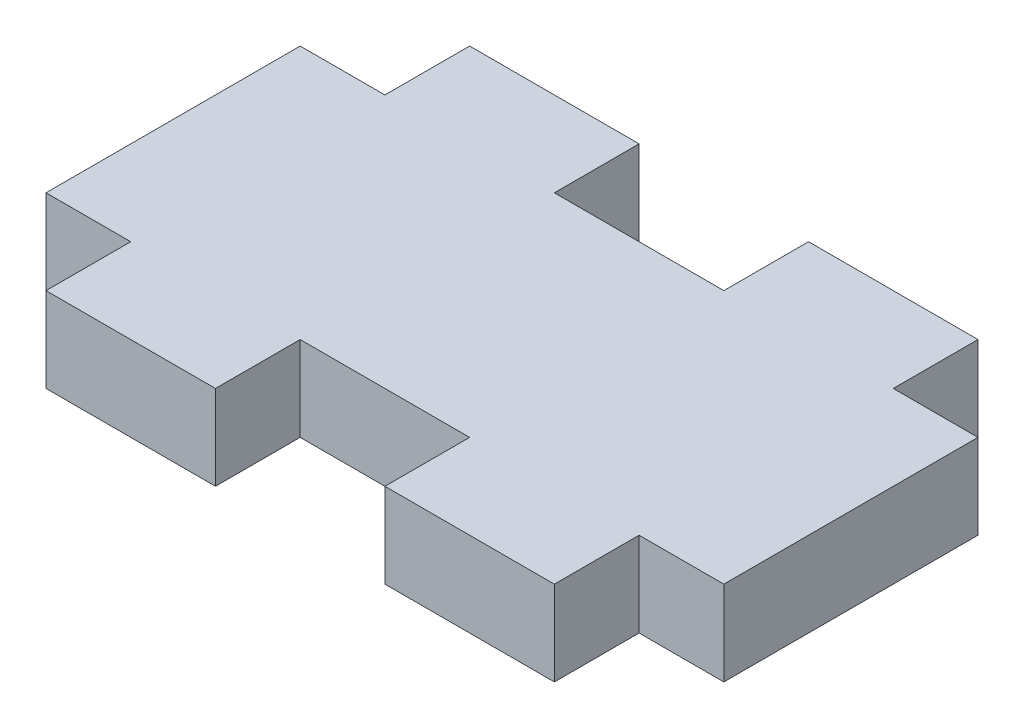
ISO-10303-21;
HEADER;
FILE_DESCRIPTION(('STEP AP214'),'2;1');
FILE_NAME('part.step','',(''),(''),'','','');
FILE_SCHEMA(('AUTOMOTIVE_DESIGN { 1 0 10303 214 1 1 1 1 }'));
ENDSEC;
DATA;
#1=APPLICATION_CONTEXT('core data for automotive mechanical design processes');
#2=APPLICATION_PROTOCOL_DEFINITION('international standard','automotive_design',2000,#1);
#3=PRODUCT_CONTEXT('',#1,'mechanical');
#4=PRODUCT('Part','Part','',(#3));
#5=PRODUCT_RELATED_PRODUCT_CATEGORY('part','',(#4));
#6=PRODUCT_DEFINITION_FORMATION('','',#4);
#7=PRODUCT_DEFINITION_CONTEXT('part definition',#1,'design');
#8=PRODUCT_DEFINITION('design','',#6,#7);
#9=PRODUCT_DEFINITION_SHAPE('','',#8);
#10=(LENGTH_UNIT() NAMED_UNIT(*) SI_UNIT(.MILLI.,.METRE.));
#11=(NAMED_UNIT(*) PLANE_ANGLE_UNIT() SI_UNIT($,.RADIAN.));
#12=(NAMED_UNIT(*) SI_UNIT($,.STERADIAN.) SOLID_ANGLE_UNIT());
#13=UNCERTAINTY_MEASURE_WITH_UNIT(LENGTH_MEASURE(1.E-05),#10,'distance_accuracy_value','');
#14=(GEOMETRIC_REPRESENTATION_CONTEXT(3) GLOBAL_UNCERTAINTY_ASSIGNED_CONTEXT((#13)) GLOBAL_UNIT_ASSIGNED_CONTEXT((#10,
#11,#12)) REPRESENTATION_CONTEXT('',''));
#15=CARTESIAN_POINT('',(0.,0.,0.));
#16=DIRECTION('',(0.,0.,1.));
#17=DIRECTION('',(1.,0.,0.));
#18=AXIS2_PLACEMENT_3D('',#15,#16,#17);
#19=CARTESIAN_POINT('',(-25.4,3.175,9.525));
#20=DIRECTION('',(0.,0.,-1.));
#21=DIRECTION('',(-1.,0.,0.));
#22=AXIS2_PLACEMENT_3D('',#19,#20,#21);
#23=PLANE('',#22);
#24=DIRECTION('',(0.,1.,0.));
#25=VECTOR('',#24,1.);
#26=CARTESIAN_POINT('',(19.05,-17.3740316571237,9.52500000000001));
#27=LINE('',#26,#25);
#28=CARTESIAN_POINT('',(19.05,-3.175,9.52500000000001));
#29=VERTEX_POINT('',#28);
#30=CARTESIAN_POINT('',(19.05,3.175,9.525));
#31=VERTEX_POINT('',#30);
#32=EDGE_CURVE('E207',#29,#31,#27,.T.);
#33=ORIENTED_EDGE('',*,*,#32,.F.);
#34=DIRECTION('',(1.,0.,0.));
#35=VECTOR('',#34,1.);
#36=CARTESIAN_POINT('',(-25.4,-3.175,9.525));
#37=LINE('',#36,#35);
#38=CARTESIAN_POINT('',(25.4,-3.175,9.525));
#39=VERTEX_POINT('',#38);
#40=EDGE_CURVE('E246',#29,#39,#37,.T.);
#41=ORIENTED_EDGE('',*,*,#40,.T.);
#42=DIRECTION('',(0.,-1.,0.));
#43=VECTOR('',#42,1.);
#44=CARTESIAN_POINT('',(25.4,3.175,9.525));
#45=LINE('',#44,#43);
#46=CARTESIAN_POINT('',(25.4,3.175,9.525));
#47=VERTEX_POINT('',#46);
#48=EDGE_CURVE('E254',#47,#39,#45,.T.);
#49=ORIENTED_EDGE('',*,*,#48,.F.);
#50=DIRECTION('',(1.,0.,0.));
#51=VECTOR('',#50,1.);
#52=CARTESIAN_POINT('',(-25.4,3.175,9.525));
#53=LINE('',#52,#51);
#54=EDGE_CURVE('E38',#31,#47,#53,.T.);
#55=ORIENTED_EDGE('',*,*,#54,.F.);
#56=EDGE_LOOP('',(#33,#41,#49,#55));
#57=FACE_BOUND('',#56,.T.);
#58=ADVANCED_FACE('F34',(#57),#23,.F.);
#59=DIRECTION('',(0.,1.,0.));
#60=VECTOR('',#59,1.);
#61=CARTESIAN_POINT('',(6.35,-17.3740316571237,9.525));
#62=LINE('',#61,#60);
#63=CARTESIAN_POINT('',(6.35,-3.175,9.525));
#64=VERTEX_POINT('',#63);
#65=CARTESIAN_POINT('',(6.35,3.175,9.525));
#66=VERTEX_POINT('',#65);
#67=EDGE_CURVE('E59',#64,#66,#62,.T.);
#68=ORIENTED_EDGE('',*,*,#67,.T.);
#69=CARTESIAN_POINT('',(-6.35,3.175,9.525));
#70=VERTEX_POINT('',#69);
#71=EDGE_CURVE('E199',#70,#66,#53,.T.);
#72=ORIENTED_EDGE('',*,*,#71,.F.);
#73=DIRECTION('',(0.,1.,0.));
#74=VECTOR('',#73,1.);
#75=CARTESIAN_POINT('',(-6.35,-17.3740316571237,9.525));
#76=LINE('',#75,#74);
#77=CARTESIAN_POINT('',(-6.35,-3.175,9.525));
#78=VERTEX_POINT('',#77);
#79=EDGE_CURVE('E227',#78,#70,#76,.T.);
#80=ORIENTED_EDGE('',*,*,#79,.F.);
#81=EDGE_CURVE('E248',#78,#64,#37,.T.);
#82=ORIENTED_EDGE('',*,*,#81,.T.);
#83=EDGE_LOOP('',(#68,#72,#80,#82));
#84=FACE_BOUND('',#83,.T.);
#85=ADVANCED_FACE('F328',(#84),#23,.F.);
#86=CARTESIAN_POINT('',(-25.4,3.175,-9.525));
#87=DIRECTION('',(0.,0.,1.));
#88=DIRECTION('',(1.,0.,0.));
#89=AXIS2_PLACEMENT_3D('',#86,#87,#88);
#90=PLANE('',#89);
#91=DIRECTION('',(-1.,0.,0.));
#92=VECTOR('',#91,1.);
#93=CARTESIAN_POINT('',(-25.4,3.175,-9.525));
#94=LINE('',#93,#92);
#95=CARTESIAN_POINT('',(6.35,3.175,-9.525));
#96=VERTEX_POINT('',#95);
#97=CARTESIAN_POINT('',(-6.35,3.175,-9.525));
#98=VERTEX_POINT('',#97);
#99=EDGE_CURVE('E265',#96,#98,#94,.T.);
#100=ORIENTED_EDGE('',*,*,#99,.F.);
#101=DIRECTION('',(0.,1.,0.));
#102=VECTOR('',#101,1.);
#103=CARTESIAN_POINT('',(6.35,-17.3740316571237,-9.525));
#104=LINE('',#103,#102);
#105=CARTESIAN_POINT('',(6.35,-3.175,-9.525));
#106=VERTEX_POINT('',#105);
#107=EDGE_CURVE('E413',#106,#96,#104,.T.);
#108=ORIENTED_EDGE('',*,*,#107,.F.);
#109=DIRECTION('',(-1.,0.,0.));
#110=VECTOR('',#109,1.);
#111=CARTESIAN_POINT('',(-25.4,-3.175,-9.525));
#112=LINE('',#111,#110);
#113=CARTESIAN_POINT('',(-6.35,-3.175,-9.525));
#114=VERTEX_POINT('',#113);
#115=EDGE_CURVE('E270',#106,#114,#112,.T.);
#116=ORIENTED_EDGE('',*,*,#115,.T.);
#117=DIRECTION('',(0.,1.,0.));
#118=VECTOR('',#117,1.);
#119=CARTESIAN_POINT('',(-6.35,-17.3740316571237,-9.525));
#120=LINE('',#119,#118);
#121=EDGE_CURVE('E364',#114,#98,#120,.T.);
#122=ORIENTED_EDGE('',*,*,#121,.T.);
#123=EDGE_LOOP('',(#100,#108,#116,#122));
#124=FACE_BOUND('',#123,.T.);
#125=ADVANCED_FACE('F333',(#124),#90,.F.);
#126=DIRECTION('',(0.,1.,0.));
#127=VECTOR('',#126,1.);
#128=CARTESIAN_POINT('',(-19.05,-17.3740316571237,-9.525));
#129=LINE('',#128,#127);
#130=CARTESIAN_POINT('',(-19.05,-3.175,-9.525));
#131=VERTEX_POINT('',#130);
#132=CARTESIAN_POINT('',(-19.05,3.175,-9.525));
#133=VERTEX_POINT('',#132);
#134=EDGE_CURVE('E359',#131,#133,#129,.T.);
#135=ORIENTED_EDGE('',*,*,#134,.F.);
#136=CARTESIAN_POINT('',(-25.4,-3.175,-9.525));
#137=VERTEX_POINT('',#136);
#138=EDGE_CURVE('E284',#131,#137,#112,.T.);
#139=ORIENTED_EDGE('',*,*,#138,.T.);
#140=DIRECTION('',(0.,-1.,0.));
#141=VECTOR('',#140,1.);
#142=CARTESIAN_POINT('',(-25.4,3.175,-9.525));
#143=LINE('',#142,#141);
#144=CARTESIAN_POINT('',(-25.4,3.175,-9.525));
#145=VERTEX_POINT('',#144);
#146=EDGE_CURVE('E44',#145,#137,#143,.T.);
#147=ORIENTED_EDGE('',*,*,#146,.F.);
#148=EDGE_CURVE('E269',#133,#145,#94,.T.);
#149=ORIENTED_EDGE('',*,*,#148,.F.);
#150=EDGE_LOOP('',(#135,#139,#147,#149));
#151=FACE_BOUND('',#150,.T.);
#152=ADVANCED_FACE('F347',(#151),#90,.F.);
#153=CARTESIAN_POINT('',(25.4,3.175,-9.525));
#154=DIRECTION('',(-1.,0.,0.));
#155=DIRECTION('',(0.,0.,1.));
#156=AXIS2_PLACEMENT_3D('',#153,#154,#155);
#157=PLANE('',#156);
#158=DIRECTION('',(0.,0.,-1.));
#159=VECTOR('',#158,1.);
#160=CARTESIAN_POINT('',(25.4,-3.175,-9.525));
#161=LINE('',#160,#159);
#162=CARTESIAN_POINT('',(25.4,-3.175,-9.525));
#163=VERTEX_POINT('',#162);
#164=EDGE_CURVE('E286',#39,#163,#161,.T.);
#165=ORIENTED_EDGE('',*,*,#164,.T.);
#166=DIRECTION('',(0.,-1.,0.));
#167=VECTOR('',#166,1.);
#168=CARTESIAN_POINT('',(25.4,3.175,-9.525));
#169=LINE('',#168,#167);
#170=CARTESIAN_POINT('',(25.4,3.175,-9.525));
#171=VERTEX_POINT('',#170);
#172=EDGE_CURVE('E11',#171,#163,#169,.T.);
#173=ORIENTED_EDGE('',*,*,#172,.F.);
#174=DIRECTION('',(0.,0.,-1.));
#175=VECTOR('',#174,1.);
#176=CARTESIAN_POINT('',(25.4,3.175,-9.525));
#177=LINE('',#176,#175);
#178=EDGE_CURVE('E264',#47,#171,#177,.T.);
#179=ORIENTED_EDGE('',*,*,#178,.F.);
#180=ORIENTED_EDGE('',*,*,#48,.T.);
#181=EDGE_LOOP('',(#165,#173,#179,#180));
#182=FACE_BOUND('',#181,.T.);
#183=ADVANCED_FACE('F36',(#182),#157,.F.);
#184=CARTESIAN_POINT('',(19.05,-3.175,-9.525));
#185=VERTEX_POINT('',#184);
#186=EDGE_CURVE('E287',#163,#185,#112,.T.);
#187=ORIENTED_EDGE('',*,*,#186,.T.);
#188=DIRECTION('',(0.,1.,0.));
#189=VECTOR('',#188,1.);
#190=CARTESIAN_POINT('',(19.05,-17.3740316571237,-9.52500000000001));
#191=LINE('',#190,#189);
#192=CARTESIAN_POINT('',(19.05,3.175,-9.525));
#193=VERTEX_POINT('',#192);
#194=EDGE_CURVE('E418',#185,#193,#191,.T.);
#195=ORIENTED_EDGE('',*,*,#194,.T.);
#196=EDGE_CURVE('E268',#171,#193,#94,.T.);
#197=ORIENTED_EDGE('',*,*,#196,.F.);
#198=ORIENTED_EDGE('',*,*,#172,.T.);
#199=EDGE_LOOP('',(#187,#195,#197,#198));
#200=FACE_BOUND('',#199,.T.);
#201=ADVANCED_FACE('F342',(#200),#90,.F.);
#202=CARTESIAN_POINT('',(-25.4,3.175,-9.525));
#203=DIRECTION('',(1.,0.,0.));
#204=DIRECTION('',(0.,0.,-1.));
#205=AXIS2_PLACEMENT_3D('',#202,#203,#204);
#206=PLANE('',#205);
#207=DIRECTION('',(0.,0.,1.));
#208=VECTOR('',#207,1.);
#209=CARTESIAN_POINT('',(-25.4,-3.175,-9.525));
#210=LINE('',#209,#208);
#211=CARTESIAN_POINT('',(-25.4,-3.175,9.525));
#212=VERTEX_POINT('',#211);
#213=EDGE_CURVE('E249',#137,#212,#210,.T.);
#214=ORIENTED_EDGE('',*,*,#213,.T.);
#215=DIRECTION('',(0.,-1.,0.));
#216=VECTOR('',#215,1.);
#217=CARTESIAN_POINT('',(-25.4,3.175,9.525));
#218=LINE('',#217,#216);
#219=CARTESIAN_POINT('',(-25.4,3.175,9.525));
#220=VERTEX_POINT('',#219);
#221=EDGE_CURVE('E303',#220,#212,#218,.T.);
#222=ORIENTED_EDGE('',*,*,#221,.F.);
#223=DIRECTION('',(0.,0.,1.));
#224=VECTOR('',#223,1.);
#225=CARTESIAN_POINT('',(-25.4,3.175,-9.525));
#226=LINE('',#225,#224);
#227=EDGE_CURVE('E276',#145,#220,#226,.T.);
#228=ORIENTED_EDGE('',*,*,#227,.F.);
#229=ORIENTED_EDGE('',*,*,#146,.T.);
#230=EDGE_LOOP('',(#214,#222,#228,#229));
#231=FACE_BOUND('',#230,.T.);
#232=ADVANCED_FACE('F311',(#231),#206,.F.);
#233=CARTESIAN_POINT('',(-19.05,-3.175,9.525));
#234=VERTEX_POINT('',#233);
#235=EDGE_CURVE('E261',#212,#234,#37,.T.);
#236=ORIENTED_EDGE('',*,*,#235,.T.);
#237=DIRECTION('',(0.,1.,0.));
#238=VECTOR('',#237,1.);
#239=CARTESIAN_POINT('',(-19.05,-17.3740316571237,9.525));
#240=LINE('',#239,#238);
#241=CARTESIAN_POINT('',(-19.05,3.175,9.525));
#242=VERTEX_POINT('',#241);
#243=EDGE_CURVE('E222',#234,#242,#240,.T.);
#244=ORIENTED_EDGE('',*,*,#243,.T.);
#245=EDGE_CURVE('E298',#220,#242,#53,.T.);
#246=ORIENTED_EDGE('',*,*,#245,.F.);
#247=ORIENTED_EDGE('',*,*,#221,.T.);
#248=EDGE_LOOP('',(#236,#244,#246,#247));
#249=FACE_BOUND('',#248,.T.);
#250=ADVANCED_FACE('F315',(#249),#23,.F.);
#251=CARTESIAN_POINT('',(0.,3.175,0.));
#252=DIRECTION('',(0.,1.,0.));
#253=DIRECTION('',(0.,0.,1.));
#254=AXIS2_PLACEMENT_3D('',#251,#252,#253);
#255=PLANE('',#254);
#256=ORIENTED_EDGE('',*,*,#178,.T.);
#257=ORIENTED_EDGE('',*,*,#196,.T.);
#258=DIRECTION('',(0.,0.,-1.));
#259=VECTOR('',#258,1.);
#260=CARTESIAN_POINT('',(19.05,3.175,-9.52500000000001));
#261=LINE('',#260,#259);
#262=CARTESIAN_POINT('',(19.05,3.175,-15.875));
#263=VERTEX_POINT('',#262);
#264=EDGE_CURVE('E407',#193,#263,#261,.T.);
#265=ORIENTED_EDGE('',*,*,#264,.T.);
#266=DIRECTION('',(-1.,0.,0.));
#267=VECTOR('',#266,1.);
#268=CARTESIAN_POINT('',(6.35,3.175,-15.875));
#269=LINE('',#268,#267);
#270=CARTESIAN_POINT('',(6.35,3.175,-15.875));
#271=VERTEX_POINT('',#270);
#272=EDGE_CURVE('E410',#263,#271,#269,.T.);
#273=ORIENTED_EDGE('',*,*,#272,.T.);
#274=DIRECTION('',(0.,0.,1.));
#275=VECTOR('',#274,1.);
#276=CARTESIAN_POINT('',(6.35,3.175,-9.525));
#277=LINE('',#276,#275);
#278=EDGE_CURVE('E233',#271,#96,#277,.T.);
#279=ORIENTED_EDGE('',*,*,#278,.T.);
#280=ORIENTED_EDGE('',*,*,#99,.T.);
#281=DIRECTION('',(0.,0.,-1.));
#282=VECTOR('',#281,1.);
#283=CARTESIAN_POINT('',(-6.35,3.175,-9.525));
#284=LINE('',#283,#282);
#285=CARTESIAN_POINT('',(-6.35,3.175,-15.875));
#286=VERTEX_POINT('',#285);
#287=EDGE_CURVE('E388',#98,#286,#284,.T.);
#288=ORIENTED_EDGE('',*,*,#287,.T.);
#289=DIRECTION('',(-1.,0.,0.));
#290=VECTOR('',#289,1.);
#291=CARTESIAN_POINT('',(-19.05,3.175,-15.875));
#292=LINE('',#291,#290);
#293=CARTESIAN_POINT('',(-19.05,3.175,-15.875));
#294=VERTEX_POINT('',#293);
#295=EDGE_CURVE('E365',#286,#294,#292,.T.);
#296=ORIENTED_EDGE('',*,*,#295,.T.);
#297=DIRECTION('',(0.,0.,1.));
#298=VECTOR('',#297,1.);
#299=CARTESIAN_POINT('',(-19.05,3.175,-9.525));
#300=LINE('',#299,#298);
#301=EDGE_CURVE('E393',#294,#133,#300,.T.);
#302=ORIENTED_EDGE('',*,*,#301,.T.);
#303=ORIENTED_EDGE('',*,*,#148,.T.);
#304=ORIENTED_EDGE('',*,*,#227,.T.);
#305=ORIENTED_EDGE('',*,*,#245,.T.);
#306=DIRECTION('',(0.,0.,-1.));
#307=VECTOR('',#306,1.);
#308=CARTESIAN_POINT('',(-19.05,3.175,9.525));
#309=LINE('',#308,#307);
#310=CARTESIAN_POINT('',(-19.05,3.175,15.875));
#311=VERTEX_POINT('',#310);
#312=EDGE_CURVE('E216',#311,#242,#309,.T.);
#313=ORIENTED_EDGE('',*,*,#312,.F.);
#314=DIRECTION('',(-1.,0.,0.));
#315=VECTOR('',#314,1.);
#316=CARTESIAN_POINT('',(-19.05,3.175,15.875));
#317=LINE('',#316,#315);
#318=CARTESIAN_POINT('',(-6.35,3.175,15.875));
#319=VERTEX_POINT('',#318);
#320=EDGE_CURVE('E212',#319,#311,#317,.T.);
#321=ORIENTED_EDGE('',*,*,#320,.F.);
#322=DIRECTION('',(0.,0.,1.));
#323=VECTOR('',#322,1.);
#324=CARTESIAN_POINT('',(-6.35,3.175,9.525));
#325=LINE('',#324,#323);
#326=EDGE_CURVE('E215',#70,#319,#325,.T.);
#327=ORIENTED_EDGE('',*,*,#326,.F.);
#328=ORIENTED_EDGE('',*,*,#71,.T.);
#329=DIRECTION('',(0.,0.,-1.));
#330=VECTOR('',#329,1.);
#331=CARTESIAN_POINT('',(6.35,3.175,9.525));
#332=LINE('',#331,#330);
#333=CARTESIAN_POINT('',(6.35,3.175,15.875));
#334=VERTEX_POINT('',#333);
#335=EDGE_CURVE('E180',#334,#66,#332,.T.);
#336=ORIENTED_EDGE('',*,*,#335,.F.);
#337=DIRECTION('',(-1.,0.,0.));
#338=VECTOR('',#337,1.);
#339=CARTESIAN_POINT('',(6.35,3.175,15.875));
#340=LINE('',#339,#338);
#341=CARTESIAN_POINT('',(19.05,3.175,15.875));
#342=VERTEX_POINT('',#341);
#343=EDGE_CURVE('E189',#342,#334,#340,.T.);
#344=ORIENTED_EDGE('',*,*,#343,.F.);
#345=DIRECTION('',(0.,0.,1.));
#346=VECTOR('',#345,1.);
#347=CARTESIAN_POINT('',(19.05,3.175,9.52500000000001));
#348=LINE('',#347,#346);
#349=EDGE_CURVE('E186',#31,#342,#348,.T.);
#350=ORIENTED_EDGE('',*,*,#349,.F.);
#351=ORIENTED_EDGE('',*,*,#54,.T.);
#352=EDGE_LOOP('',(#256,#257,#265,#273,#279,#280,#288,#296,#302,#303,#304,#305,#313,#321,#327,
#328,#336,#344,#350,#351));
#353=FACE_BOUND('',#352,.T.);
#354=ADVANCED_FACE('F197',(#353),#255,.T.);
#355=CARTESIAN_POINT('',(0.,-3.175,0.));
#356=DIRECTION('',(0.,1.,0.));
#357=DIRECTION('',(0.,0.,1.));
#358=AXIS2_PLACEMENT_3D('',#355,#356,#357);
#359=PLANE('',#358);
#360=ORIENTED_EDGE('',*,*,#164,.F.);
#361=ORIENTED_EDGE('',*,*,#40,.F.);
#362=DIRECTION('',(0.,0.,-1.));
#363=VECTOR('',#362,1.);
#364=CARTESIAN_POINT('',(19.05,-3.175,9.52500000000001));
#365=LINE('',#364,#363);
#366=CARTESIAN_POINT('',(19.05,-3.175,15.875));
#367=VERTEX_POINT('',#366);
#368=EDGE_CURVE('E211',#367,#29,#365,.T.);
#369=ORIENTED_EDGE('',*,*,#368,.F.);
#370=DIRECTION('',(1.,0.,0.));
#371=VECTOR('',#370,1.);
#372=CARTESIAN_POINT('',(6.35,-3.175,15.875));
#373=LINE('',#372,#371);
#374=CARTESIAN_POINT('',(6.35,-3.175,15.875));
#375=VERTEX_POINT('',#374);
#376=EDGE_CURVE('E206',#375,#367,#373,.T.);
#377=ORIENTED_EDGE('',*,*,#376,.F.);
#378=DIRECTION('',(0.,0.,1.));
#379=VECTOR('',#378,1.);
#380=CARTESIAN_POINT('',(6.35,-3.175,9.525));
#381=LINE('',#380,#379);
#382=EDGE_CURVE('E182',#64,#375,#381,.T.);
#383=ORIENTED_EDGE('',*,*,#382,.F.);
#384=ORIENTED_EDGE('',*,*,#81,.F.);
#385=DIRECTION('',(0.,0.,-1.));
#386=VECTOR('',#385,1.);
#387=CARTESIAN_POINT('',(-6.35,-3.175,9.525));
#388=LINE('',#387,#386);
#389=CARTESIAN_POINT('',(-6.35,-3.175,15.875));
#390=VERTEX_POINT('',#389);
#391=EDGE_CURVE('E234',#390,#78,#388,.T.);
#392=ORIENTED_EDGE('',*,*,#391,.F.);
#393=DIRECTION('',(1.,0.,0.));
#394=VECTOR('',#393,1.);
#395=CARTESIAN_POINT('',(-19.05,-3.175,15.875));
#396=LINE('',#395,#394);
#397=CARTESIAN_POINT('',(-19.05,-3.175,15.875));
#398=VERTEX_POINT('',#397);
#399=EDGE_CURVE('E226',#398,#390,#396,.T.);
#400=ORIENTED_EDGE('',*,*,#399,.F.);
#401=DIRECTION('',(0.,0.,1.));
#402=VECTOR('',#401,1.);
#403=CARTESIAN_POINT('',(-19.05,-3.175,9.525));
#404=LINE('',#403,#402);
#405=EDGE_CURVE('E230',#234,#398,#404,.T.);
#406=ORIENTED_EDGE('',*,*,#405,.F.);
#407=ORIENTED_EDGE('',*,*,#235,.F.);
#408=ORIENTED_EDGE('',*,*,#213,.F.);
#409=ORIENTED_EDGE('',*,*,#138,.F.);
#410=DIRECTION('',(0.,0.,-1.));
#411=VECTOR('',#410,1.);
#412=CARTESIAN_POINT('',(-19.05,-3.175,-9.525));
#413=LINE('',#412,#411);
#414=CARTESIAN_POINT('',(-19.05,-3.175,-15.875));
#415=VERTEX_POINT('',#414);
#416=EDGE_CURVE('E293',#131,#415,#413,.T.);
#417=ORIENTED_EDGE('',*,*,#416,.T.);
#418=DIRECTION('',(1.,0.,0.));
#419=VECTOR('',#418,1.);
#420=CARTESIAN_POINT('',(-19.05,-3.175,-15.875));
#421=LINE('',#420,#419);
#422=CARTESIAN_POINT('',(-6.35,-3.175,-15.875));
#423=VERTEX_POINT('',#422);
#424=EDGE_CURVE('E370',#415,#423,#421,.T.);
#425=ORIENTED_EDGE('',*,*,#424,.T.);
#426=DIRECTION('',(0.,0.,1.));
#427=VECTOR('',#426,1.);
#428=CARTESIAN_POINT('',(-6.35,-3.175,-9.525));
#429=LINE('',#428,#427);
#430=EDGE_CURVE('E372',#423,#114,#429,.T.);
#431=ORIENTED_EDGE('',*,*,#430,.T.);
#432=ORIENTED_EDGE('',*,*,#115,.F.);
#433=DIRECTION('',(0.,0.,-1.));
#434=VECTOR('',#433,1.);
#435=CARTESIAN_POINT('',(6.35,-3.175,-9.525));
#436=LINE('',#435,#434);
#437=CARTESIAN_POINT('',(6.35,-3.175,-15.875));
#438=VERTEX_POINT('',#437);
#439=EDGE_CURVE('E394',#106,#438,#436,.T.);
#440=ORIENTED_EDGE('',*,*,#439,.T.);
#441=DIRECTION('',(1.,0.,0.));
#442=VECTOR('',#441,1.);
#443=CARTESIAN_POINT('',(6.35,-3.175,-15.875));
#444=LINE('',#443,#442);
#445=CARTESIAN_POINT('',(19.05,-3.175,-15.875));
#446=VERTEX_POINT('',#445);
#447=EDGE_CURVE('E397',#438,#446,#444,.T.);
#448=ORIENTED_EDGE('',*,*,#447,.T.);
#449=DIRECTION('',(0.,0.,1.));
#450=VECTOR('',#449,1.);
#451=CARTESIAN_POINT('',(19.05,-3.175,-9.52500000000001));
#452=LINE('',#451,#450);
#453=EDGE_CURVE('E401',#446,#185,#452,.T.);
#454=ORIENTED_EDGE('',*,*,#453,.T.);
#455=ORIENTED_EDGE('',*,*,#186,.F.);
#456=EDGE_LOOP('',(#360,#361,#369,#377,#383,#384,#392,#400,#406,#407,#408,#409,#417,#425,#431,
#432,#440,#448,#454,#455));
#457=FACE_BOUND('',#456,.T.);
#458=ADVANCED_FACE('F326',(#457),#359,.F.);
#459=CARTESIAN_POINT('',(-19.05,-17.3740316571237,-9.525));
#460=DIRECTION('',(-1.,0.,0.));
#461=DIRECTION('',(0.,0.,1.));
#462=AXIS2_PLACEMENT_3D('',#459,#460,#461);
#463=PLANE('',#462);
#464=ORIENTED_EDGE('',*,*,#416,.F.);
#465=ORIENTED_EDGE('',*,*,#134,.T.);
#466=ORIENTED_EDGE('',*,*,#301,.F.);
#467=DIRECTION('',(0.,1.,0.));
#468=VECTOR('',#467,1.);
#469=CARTESIAN_POINT('',(-19.05,-17.3740316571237,-15.875));
#470=LINE('',#469,#468);
#471=EDGE_CURVE('E369',#415,#294,#470,.T.);
#472=ORIENTED_EDGE('',*,*,#471,.F.);
#473=EDGE_LOOP('',(#464,#465,#466,#472));
#474=FACE_BOUND('',#473,.T.);
#475=ADVANCED_FACE('F368',(#474),#463,.T.);
#476=CARTESIAN_POINT('',(-19.05,-17.3740316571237,-15.875));
#477=DIRECTION('',(0.,0.,-1.));
#478=DIRECTION('',(-1.,0.,0.));
#479=AXIS2_PLACEMENT_3D('',#476,#477,#478);
#480=PLANE('',#479);
#481=ORIENTED_EDGE('',*,*,#424,.F.);
#482=ORIENTED_EDGE('',*,*,#471,.T.);
#483=ORIENTED_EDGE('',*,*,#295,.F.);
#484=DIRECTION('',(0.,1.,0.));
#485=VECTOR('',#484,1.);
#486=CARTESIAN_POINT('',(-6.35,-17.3740316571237,-15.875));
#487=LINE('',#486,#485);
#488=EDGE_CURVE('E387',#423,#286,#487,.T.);
#489=ORIENTED_EDGE('',*,*,#488,.F.);
#490=EDGE_LOOP('',(#481,#482,#483,#489));
#491=FACE_BOUND('',#490,.T.);
#492=ADVANCED_FACE('F430',(#491),#480,.T.);
#493=CARTESIAN_POINT('',(-6.35,-17.3740316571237,-9.525));
#494=DIRECTION('',(1.,0.,0.));
#495=DIRECTION('',(0.,0.,-1.));
#496=AXIS2_PLACEMENT_3D('',#493,#494,#495);
#497=PLANE('',#496);
#498=ORIENTED_EDGE('',*,*,#430,.F.);
#499=ORIENTED_EDGE('',*,*,#488,.T.);
#500=ORIENTED_EDGE('',*,*,#287,.F.);
#501=ORIENTED_EDGE('',*,*,#121,.F.);
#502=EDGE_LOOP('',(#498,#499,#500,#501));
#503=FACE_BOUND('',#502,.T.);
#504=ADVANCED_FACE('F428',(#503),#497,.T.);
#505=CARTESIAN_POINT('',(6.35,-17.3740316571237,-9.525));
#506=DIRECTION('',(-1.,0.,0.));
#507=DIRECTION('',(0.,0.,1.));
#508=AXIS2_PLACEMENT_3D('',#505,#506,#507);
#509=PLANE('',#508);
#510=ORIENTED_EDGE('',*,*,#439,.F.);
#511=ORIENTED_EDGE('',*,*,#107,.T.);
#512=ORIENTED_EDGE('',*,*,#278,.F.);
#513=DIRECTION('',(0.,1.,0.));
#514=VECTOR('',#513,1.);
#515=CARTESIAN_POINT('',(6.35,-17.3740316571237,-15.875));
#516=LINE('',#515,#514);
#517=EDGE_CURVE('E414',#438,#271,#516,.T.);
#518=ORIENTED_EDGE('',*,*,#517,.F.);
#519=EDGE_LOOP('',(#510,#511,#512,#518));
#520=FACE_BOUND('',#519,.T.);
#521=ADVANCED_FACE('F437',(#520),#509,.T.);
#522=CARTESIAN_POINT('',(6.35,-17.3740316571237,-15.875));
#523=DIRECTION('',(0.,0.,-1.));
#524=DIRECTION('',(-1.,0.,0.));
#525=AXIS2_PLACEMENT_3D('',#522,#523,#524);
#526=PLANE('',#525);
#527=ORIENTED_EDGE('',*,*,#447,.F.);
#528=ORIENTED_EDGE('',*,*,#517,.T.);
#529=ORIENTED_EDGE('',*,*,#272,.F.);
#530=DIRECTION('',(0.,1.,0.));
#531=VECTOR('',#530,1.);
#532=CARTESIAN_POINT('',(19.05,-17.3740316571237,-15.875));
#533=LINE('',#532,#531);
#534=EDGE_CURVE('E416',#446,#263,#533,.T.);
#535=ORIENTED_EDGE('',*,*,#534,.F.);
#536=EDGE_LOOP('',(#527,#528,#529,#535));
#537=FACE_BOUND('',#536,.T.);
#538=ADVANCED_FACE('F474',(#537),#526,.T.);
#539=CARTESIAN_POINT('',(19.05,-17.3740316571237,-9.52500000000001));
#540=DIRECTION('',(1.,0.,0.));
#541=DIRECTION('',(0.,0.,-1.));
#542=AXIS2_PLACEMENT_3D('',#539,#540,#541);
#543=PLANE('',#542);
#544=ORIENTED_EDGE('',*,*,#453,.F.);
#545=ORIENTED_EDGE('',*,*,#534,.T.);
#546=ORIENTED_EDGE('',*,*,#264,.F.);
#547=ORIENTED_EDGE('',*,*,#194,.F.);
#548=EDGE_LOOP('',(#544,#545,#546,#547));
#549=FACE_BOUND('',#548,.T.);
#550=ADVANCED_FACE('F483',(#549),#543,.T.);
#551=CARTESIAN_POINT('',(-19.05,-17.3740316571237,15.875));
#552=DIRECTION('',(0.,0.,-1.));
#553=DIRECTION('',(-1.,0.,0.));
#554=AXIS2_PLACEMENT_3D('',#551,#552,#553);
#555=PLANE('',#554);
#556=DIRECTION('',(0.,1.,0.));
#557=VECTOR('',#556,1.);
#558=CARTESIAN_POINT('',(-19.05,-17.3740316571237,15.875));
#559=LINE('',#558,#557);
#560=EDGE_CURVE('E244',#398,#311,#559,.T.);
#561=ORIENTED_EDGE('',*,*,#560,.F.);
#562=ORIENTED_EDGE('',*,*,#399,.T.);
#563=DIRECTION('',(0.,1.,0.));
#564=VECTOR('',#563,1.);
#565=CARTESIAN_POINT('',(-6.35,-17.3740316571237,15.875));
#566=LINE('',#565,#564);
#567=EDGE_CURVE('E238',#390,#319,#566,.T.);
#568=ORIENTED_EDGE('',*,*,#567,.T.);
#569=ORIENTED_EDGE('',*,*,#320,.T.);
#570=EDGE_LOOP('',(#561,#562,#568,#569));
#571=FACE_BOUND('',#570,.T.);
#572=ADVANCED_FACE('F492',(#571),#555,.F.);
#573=CARTESIAN_POINT('',(-6.35,-17.3740316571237,9.525));
#574=DIRECTION('',(-1.,0.,0.));
#575=DIRECTION('',(0.,0.,1.));
#576=AXIS2_PLACEMENT_3D('',#573,#574,#575);
#577=PLANE('',#576);
#578=ORIENTED_EDGE('',*,*,#567,.F.);
#579=ORIENTED_EDGE('',*,*,#391,.T.);
#580=ORIENTED_EDGE('',*,*,#79,.T.);
#581=ORIENTED_EDGE('',*,*,#326,.T.);
#582=EDGE_LOOP('',(#578,#579,#580,#581));
#583=FACE_BOUND('',#582,.T.);
#584=ADVANCED_FACE('F531',(#583),#577,.F.);
#585=CARTESIAN_POINT('',(-19.05,-17.3740316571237,9.525));
#586=DIRECTION('',(1.,0.,0.));
#587=DIRECTION('',(0.,0.,-1.));
#588=AXIS2_PLACEMENT_3D('',#585,#586,#587);
#589=PLANE('',#588);
#590=ORIENTED_EDGE('',*,*,#243,.F.);
#591=ORIENTED_EDGE('',*,*,#405,.T.);
#592=ORIENTED_EDGE('',*,*,#560,.T.);
#593=ORIENTED_EDGE('',*,*,#312,.T.);
#594=EDGE_LOOP('',(#590,#591,#592,#593));
#595=FACE_BOUND('',#594,.T.);
#596=ADVANCED_FACE('F318',(#595),#589,.F.);
#597=CARTESIAN_POINT('',(6.35,-17.3740316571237,15.875));
#598=DIRECTION('',(0.,0.,-1.));
#599=DIRECTION('',(-1.,0.,0.));
#600=AXIS2_PLACEMENT_3D('',#597,#598,#599);
#601=PLANE('',#600);
#602=DIRECTION('',(0.,1.,0.));
#603=VECTOR('',#602,1.);
#604=CARTESIAN_POINT('',(6.35,-17.3740316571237,15.875));
#605=LINE('',#604,#603);
#606=EDGE_CURVE('E176',#375,#334,#605,.T.);
#607=ORIENTED_EDGE('',*,*,#606,.F.);
#608=ORIENTED_EDGE('',*,*,#376,.T.);
#609=DIRECTION('',(0.,1.,0.));
#610=VECTOR('',#609,1.);
#611=CARTESIAN_POINT('',(19.05,-17.3740316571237,15.875));
#612=LINE('',#611,#610);
#613=EDGE_CURVE('E185',#367,#342,#612,.T.);
#614=ORIENTED_EDGE('',*,*,#613,.T.);
#615=ORIENTED_EDGE('',*,*,#343,.T.);
#616=EDGE_LOOP('',(#607,#608,#614,#615));
#617=FACE_BOUND('',#616,.T.);
#618=ADVANCED_FACE('F190',(#617),#601,.F.);
#619=CARTESIAN_POINT('',(19.05,-17.3740316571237,9.52500000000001));
#620=DIRECTION('',(-1.,0.,0.));
#621=DIRECTION('',(0.,0.,1.));
#622=AXIS2_PLACEMENT_3D('',#619,#620,#621);
#623=PLANE('',#622);
#624=ORIENTED_EDGE('',*,*,#613,.F.);
#625=ORIENTED_EDGE('',*,*,#368,.T.);
#626=ORIENTED_EDGE('',*,*,#32,.T.);
#627=ORIENTED_EDGE('',*,*,#349,.T.);
#628=EDGE_LOOP('',(#624,#625,#626,#627));
#629=FACE_BOUND('',#628,.T.);
#630=ADVANCED_FACE('F323',(#629),#623,.F.);
#631=CARTESIAN_POINT('',(6.35,-17.3740316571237,9.525));
#632=DIRECTION('',(1.,0.,0.));
#633=DIRECTION('',(0.,0.,-1.));
#634=AXIS2_PLACEMENT_3D('',#631,#632,#633);
#635=PLANE('',#634);
#636=ORIENTED_EDGE('',*,*,#67,.F.);
#637=ORIENTED_EDGE('',*,*,#382,.T.);
#638=ORIENTED_EDGE('',*,*,#606,.T.);
#639=ORIENTED_EDGE('',*,*,#335,.T.);
#640=EDGE_LOOP('',(#636,#637,#638,#639));
#641=FACE_BOUND('',#640,.T.);
#642=ADVANCED_FACE('F178',(#641),#635,.F.);
#643=CLOSED_SHELL('',(#58,#85,#125,#152,#183,#201,#232,#250,#354,#458,#475,#492,#504,#521,#538,
#550,#572,#584,#596,#618,#630,#642));
#644=MANIFOLD_SOLID_BREP('B2',#643);
#645=ADVANCED_BREP_SHAPE_REPRESENTATION('',(#18,#644),#14);
#646=SHAPE_DEFINITION_REPRESENTATION(#9,#645);
ENDSEC;
END-ISO-10303-21;
